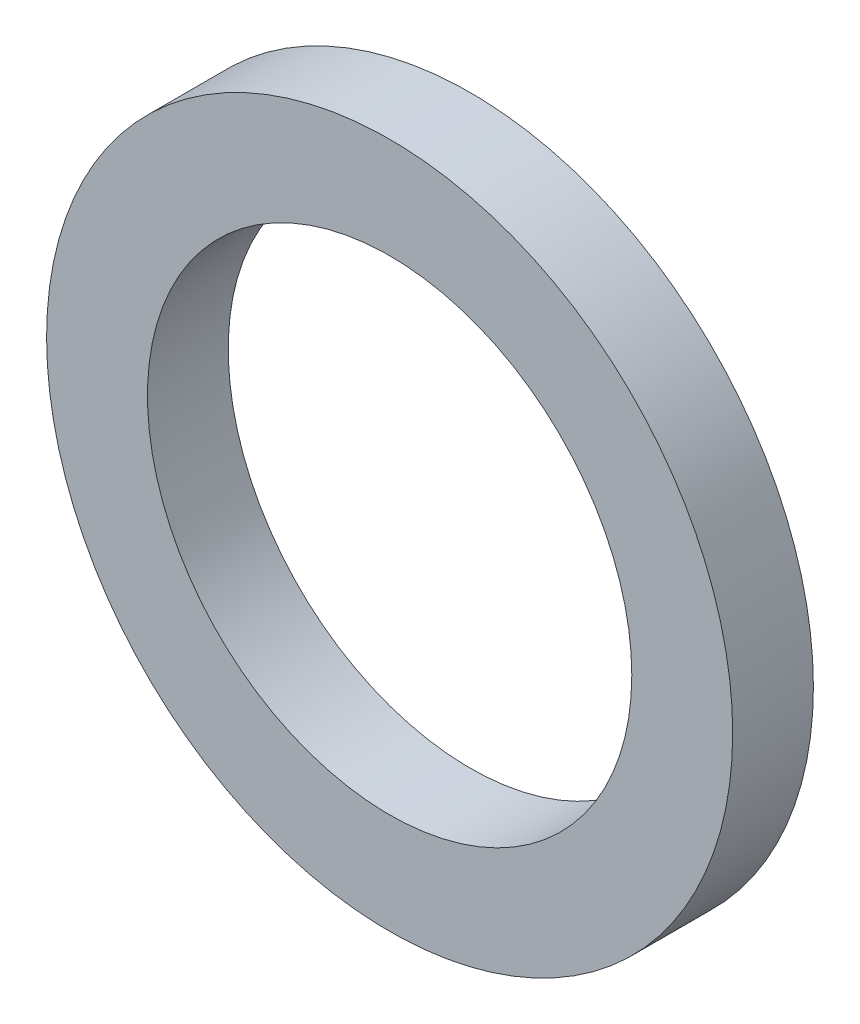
ISO-10303-21;
HEADER;
FILE_DESCRIPTION(('STEP AP214'),'2;1');
FILE_NAME('part.step','',(''),(''),'','','');
FILE_SCHEMA(('AUTOMOTIVE_DESIGN { 1 0 10303 214 1 1 1 1 }'));
ENDSEC;
DATA;
#1=APPLICATION_CONTEXT('core data for automotive mechanical design processes');
#2=APPLICATION_PROTOCOL_DEFINITION('international standard','automotive_design',2000,#1);
#3=PRODUCT_CONTEXT('',#1,'mechanical');
#4=PRODUCT('Part','Part','',(#3));
#5=PRODUCT_RELATED_PRODUCT_CATEGORY('part','',(#4));
#6=PRODUCT_DEFINITION_FORMATION('','',#4);
#7=PRODUCT_DEFINITION_CONTEXT('part definition',#1,'design');
#8=PRODUCT_DEFINITION('design','',#6,#7);
#9=PRODUCT_DEFINITION_SHAPE('','',#8);
#10=(LENGTH_UNIT() NAMED_UNIT(*) SI_UNIT(.MILLI.,.METRE.));
#11=(NAMED_UNIT(*) PLANE_ANGLE_UNIT() SI_UNIT($,.RADIAN.));
#12=(NAMED_UNIT(*) SI_UNIT($,.STERADIAN.) SOLID_ANGLE_UNIT());
#13=UNCERTAINTY_MEASURE_WITH_UNIT(LENGTH_MEASURE(1.E-05),#10,'distance_accuracy_value','');
#14=(GEOMETRIC_REPRESENTATION_CONTEXT(3) GLOBAL_UNCERTAINTY_ASSIGNED_CONTEXT((#13)) GLOBAL_UNIT_ASSIGNED_CONTEXT((#10,
#11,#12)) REPRESENTATION_CONTEXT('',''));
#15=CARTESIAN_POINT('',(0.,0.,0.));
#16=DIRECTION('',(0.,0.,1.));
#17=DIRECTION('',(1.,0.,0.));
#18=AXIS2_PLACEMENT_3D('',#15,#16,#17);
#19=CARTESIAN_POINT('',(0.,0.,2.));
#20=DIRECTION('',(0.,0.,-1.));
#21=DIRECTION('',(0.,1.,0.));
#22=AXIS2_PLACEMENT_3D('',#19,#20,#21);
#23=CYLINDRICAL_SURFACE('',#22,6.);
#24=CARTESIAN_POINT('',(0.,0.,2.));
#25=DIRECTION('',(0.,0.,-1.));
#26=DIRECTION('',(1.,0.,0.));
#27=AXIS2_PLACEMENT_3D('',#24,#25,#26);
#28=CIRCLE('',#27,6.);
#29=CARTESIAN_POINT('',(6.,0.,2.));
#30=VERTEX_POINT('',#29);
#31=EDGE_CURVE('E8',#30,#30,#28,.T.);
#32=ORIENTED_EDGE('',*,*,#31,.F.);
#33=EDGE_LOOP('',(#32));
#34=FACE_BOUND('',#33,.T.);
#35=CARTESIAN_POINT('',(0.,0.,0.));
#36=DIRECTION('',(0.,0.,-1.));
#37=DIRECTION('',(1.,0.,0.));
#38=AXIS2_PLACEMENT_3D('',#35,#36,#37);
#39=CIRCLE('',#38,6.);
#40=CARTESIAN_POINT('',(6.,0.,0.));
#41=VERTEX_POINT('',#40);
#42=EDGE_CURVE('E23',#41,#41,#39,.T.);
#43=ORIENTED_EDGE('',*,*,#42,.T.);
#44=EDGE_LOOP('',(#43));
#45=FACE_BOUND('',#44,.T.);
#46=ADVANCED_FACE('F12',(#34,#45),#23,.F.);
#47=CARTESIAN_POINT('',(0.,0.,2.));
#48=DIRECTION('',(0.,0.,-1.));
#49=DIRECTION('',(0.,1.,0.));
#50=AXIS2_PLACEMENT_3D('',#47,#48,#49);
#51=CYLINDRICAL_SURFACE('',#50,8.5);
#52=CARTESIAN_POINT('',(0.,0.,2.));
#53=DIRECTION('',(0.,0.,-1.));
#54=DIRECTION('',(1.,0.,0.));
#55=AXIS2_PLACEMENT_3D('',#52,#53,#54);
#56=CIRCLE('',#55,8.5);
#57=CARTESIAN_POINT('',(8.5,0.,2.));
#58=VERTEX_POINT('',#57);
#59=EDGE_CURVE('E19',#58,#58,#56,.T.);
#60=ORIENTED_EDGE('',*,*,#59,.T.);
#61=EDGE_LOOP('',(#60));
#62=FACE_BOUND('',#61,.T.);
#63=CARTESIAN_POINT('',(0.,0.,0.));
#64=DIRECTION('',(0.,0.,-1.));
#65=DIRECTION('',(1.,0.,0.));
#66=AXIS2_PLACEMENT_3D('',#63,#64,#65);
#67=CIRCLE('',#66,8.5);
#68=CARTESIAN_POINT('',(8.5,0.,0.));
#69=VERTEX_POINT('',#68);
#70=EDGE_CURVE('E28',#69,#69,#67,.T.);
#71=ORIENTED_EDGE('',*,*,#70,.F.);
#72=EDGE_LOOP('',(#71));
#73=FACE_BOUND('',#72,.T.);
#74=ADVANCED_FACE('F14',(#62,#73),#51,.T.);
#75=CARTESIAN_POINT('',(0.,0.,2.));
#76=DIRECTION('',(0.,0.,-1.));
#77=DIRECTION('',(0.,1.,0.));
#78=AXIS2_PLACEMENT_3D('',#75,#76,#77);
#79=PLANE('',#78);
#80=ORIENTED_EDGE('',*,*,#31,.T.);
#81=EDGE_LOOP('',(#80));
#82=FACE_BOUND('',#81,.T.);
#83=ORIENTED_EDGE('',*,*,#59,.F.);
#84=EDGE_LOOP('',(#83));
#85=FACE_BOUND('',#84,.T.);
#86=ADVANCED_FACE('F40',(#82,#85),#79,.F.);
#87=CARTESIAN_POINT('',(0.,0.,0.));
#88=DIRECTION('',(0.,0.,-1.));
#89=DIRECTION('',(0.,1.,0.));
#90=AXIS2_PLACEMENT_3D('',#87,#88,#89);
#91=PLANE('',#90);
#92=ORIENTED_EDGE('',*,*,#42,.F.);
#93=EDGE_LOOP('',(#92));
#94=FACE_BOUND('',#93,.T.);
#95=ORIENTED_EDGE('',*,*,#70,.T.);
#96=EDGE_LOOP('',(#95));
#97=FACE_BOUND('',#96,.T.);
#98=ADVANCED_FACE('F37',(#94,#97),#91,.T.);
#99=CLOSED_SHELL('',(#46,#74,#86,#98));
#100=MANIFOLD_SOLID_BREP('B1',#99);
#101=ADVANCED_BREP_SHAPE_REPRESENTATION('',(#18,#100),#14);
#102=SHAPE_DEFINITION_REPRESENTATION(#9,#101);
ENDSEC;
END-ISO-10303-21;
